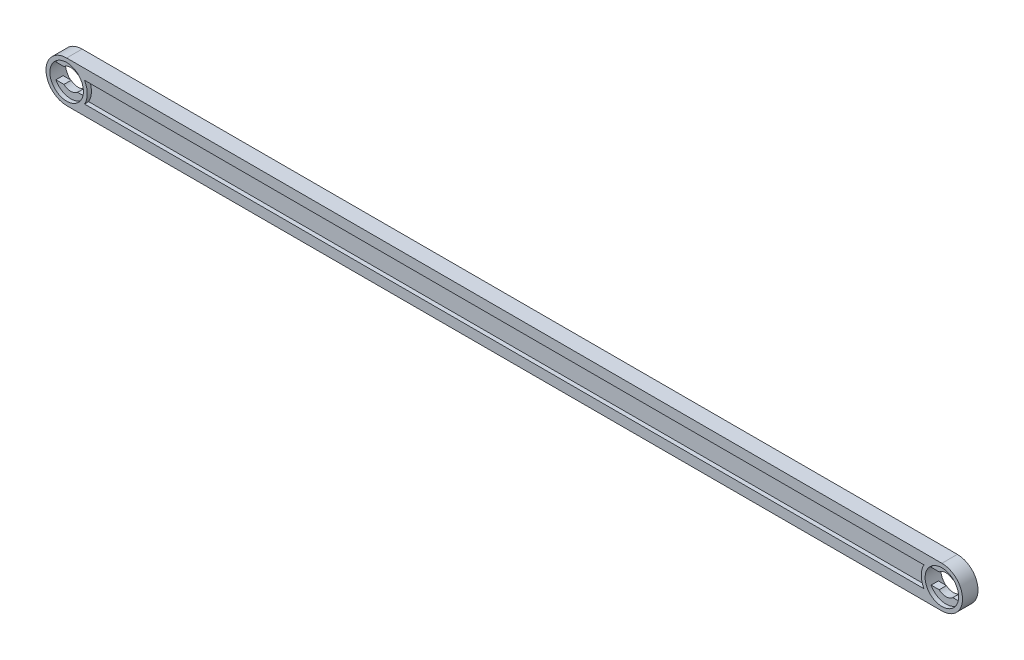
ISO-10303-21;
HEADER;
FILE_DESCRIPTION(('STEP AP214'),'2;1');
FILE_NAME('part.step','',(''),(''),'','','');
FILE_SCHEMA(('AUTOMOTIVE_DESIGN { 1 0 10303 214 1 1 1 1 }'));
ENDSEC;
DATA;
#1=APPLICATION_CONTEXT('core data for automotive mechanical design processes');
#2=APPLICATION_PROTOCOL_DEFINITION('international standard','automotive_design',2000,#1);
#3=PRODUCT_CONTEXT('',#1,'mechanical');
#4=PRODUCT('Part','Part','',(#3));
#5=PRODUCT_RELATED_PRODUCT_CATEGORY('part','',(#4));
#6=PRODUCT_DEFINITION_FORMATION('','',#4);
#7=PRODUCT_DEFINITION_CONTEXT('part definition',#1,'design');
#8=PRODUCT_DEFINITION('design','',#6,#7);
#9=PRODUCT_DEFINITION_SHAPE('','',#8);
#10=(LENGTH_UNIT() NAMED_UNIT(*) SI_UNIT(.MILLI.,.METRE.));
#11=(NAMED_UNIT(*) PLANE_ANGLE_UNIT() SI_UNIT($,.RADIAN.));
#12=(NAMED_UNIT(*) SI_UNIT($,.STERADIAN.) SOLID_ANGLE_UNIT());
#13=UNCERTAINTY_MEASURE_WITH_UNIT(LENGTH_MEASURE(1.E-05),#10,'distance_accuracy_value','');
#14=(GEOMETRIC_REPRESENTATION_CONTEXT(3) GLOBAL_UNCERTAINTY_ASSIGNED_CONTEXT((#13)) GLOBAL_UNIT_ASSIGNED_CONTEXT((#10,
#11,#12)) REPRESENTATION_CONTEXT('',''));
#15=CARTESIAN_POINT('',(0.,0.,0.));
#16=DIRECTION('',(0.,0.,1.));
#17=DIRECTION('',(1.,0.,0.));
#18=AXIS2_PLACEMENT_3D('',#15,#16,#17);
#19=CARTESIAN_POINT('',(0.,0.,-3.));
#20=DIRECTION('',(0.,0.,1.));
#21=DIRECTION('',(1.,0.,0.));
#22=AXIS2_PLACEMENT_3D('',#19,#20,#21);
#23=PLANE('',#22);
#24=DIRECTION('',(0.,-1.,0.));
#25=VECTOR('',#24,1.);
#26=CARTESIAN_POINT('',(165.6,-2.,-3.));
#27=LINE('',#26,#25);
#28=CARTESIAN_POINT('',(165.6,2.,-3.));
#29=VERTEX_POINT('',#28);
#30=CARTESIAN_POINT('',(165.6,-2.,-3.));
#31=VERTEX_POINT('',#30);
#32=EDGE_CURVE('E248',#29,#31,#27,.T.);
#33=ORIENTED_EDGE('',*,*,#32,.F.);
#34=DIRECTION('',(1.,0.,0.));
#35=VECTOR('',#34,1.);
#36=CARTESIAN_POINT('',(165.6,2.,-3.));
#37=LINE('',#36,#35);
#38=CARTESIAN_POINT('',(4.,2.,-3.));
#39=VERTEX_POINT('',#38);
#40=EDGE_CURVE('E49',#39,#29,#37,.T.);
#41=ORIENTED_EDGE('',*,*,#40,.F.);
#42=DIRECTION('',(0.,1.,0.));
#43=VECTOR('',#42,1.);
#44=CARTESIAN_POINT('',(4.00000000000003,-2.,-3.));
#45=LINE('',#44,#43);
#46=CARTESIAN_POINT('',(4.00000000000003,-2.,-3.));
#47=VERTEX_POINT('',#46);
#48=EDGE_CURVE('E239',#47,#39,#45,.T.);
#49=ORIENTED_EDGE('',*,*,#48,.F.);
#50=DIRECTION('',(-1.,0.,0.));
#51=VECTOR('',#50,1.);
#52=CARTESIAN_POINT('',(165.6,-2.,-3.));
#53=LINE('',#52,#51);
#54=EDGE_CURVE('E242',#31,#47,#53,.T.);
#55=ORIENTED_EDGE('',*,*,#54,.F.);
#56=EDGE_LOOP('',(#33,#41,#49,#55));
#57=FACE_BOUND('',#56,.T.);
#58=CARTESIAN_POINT('',(0.,0.,-3.));
#59=DIRECTION('',(0.,0.,1.));
#60=DIRECTION('',(1.,0.,0.));
#61=AXIS2_PLACEMENT_3D('',#58,#59,#60);
#62=CIRCLE('',#61,4.);
#63=CARTESIAN_POINT('',(0.,4.,-3.));
#64=VERTEX_POINT('',#63);
#65=CARTESIAN_POINT('',(0.,-4.,-3.));
#66=VERTEX_POINT('',#65);
#67=EDGE_CURVE('E414',#64,#66,#62,.T.);
#68=ORIENTED_EDGE('',*,*,#67,.F.);
#69=DIRECTION('',(-1.,0.,0.));
#70=VECTOR('',#69,1.);
#71=CARTESIAN_POINT('',(0.,4.,-3.));
#72=LINE('',#71,#70);
#73=CARTESIAN_POINT('',(169.6,4.,-3.));
#74=VERTEX_POINT('',#73);
#75=EDGE_CURVE('E424',#74,#64,#72,.T.);
#76=ORIENTED_EDGE('',*,*,#75,.F.);
#77=CARTESIAN_POINT('',(169.6,0.,-3.));
#78=DIRECTION('',(0.,0.,1.));
#79=DIRECTION('',(1.,0.,0.));
#80=AXIS2_PLACEMENT_3D('',#77,#78,#79);
#81=CIRCLE('',#80,4.);
#82=CARTESIAN_POINT('',(169.6,-4.,-3.));
#83=VERTEX_POINT('',#82);
#84=EDGE_CURVE('E421',#83,#74,#81,.T.);
#85=ORIENTED_EDGE('',*,*,#84,.F.);
#86=DIRECTION('',(1.,0.,0.));
#87=VECTOR('',#86,1.);
#88=CARTESIAN_POINT('',(0.,-4.,-3.));
#89=LINE('',#88,#87);
#90=EDGE_CURVE('E417',#66,#83,#89,.T.);
#91=ORIENTED_EDGE('',*,*,#90,.F.);
#92=EDGE_LOOP('',(#68,#76,#85,#91));
#93=FACE_BOUND('',#92,.T.);
#94=CARTESIAN_POINT('',(0.,0.,-3.));
#95=DIRECTION('',(0.,0.,1.));
#96=DIRECTION('',(1.,0.,0.));
#97=AXIS2_PLACEMENT_3D('',#94,#95,#96);
#98=CIRCLE('',#97,3.25);
#99=CARTESIAN_POINT('',(3.25,0.,-3.));
#100=VERTEX_POINT('',#99);
#101=EDGE_CURVE('E391',#100,#100,#98,.F.);
#102=ORIENTED_EDGE('',*,*,#101,.F.);
#103=EDGE_LOOP('',(#102));
#104=FACE_BOUND('',#103,.T.);
#105=CARTESIAN_POINT('',(169.6,0.,-3.));
#106=DIRECTION('',(0.,0.,1.));
#107=DIRECTION('',(1.,0.,0.));
#108=AXIS2_PLACEMENT_3D('',#105,#106,#107);
#109=CIRCLE('',#108,3.25);
#110=CARTESIAN_POINT('',(172.85,0.,-3.));
#111=VERTEX_POINT('',#110);
#112=EDGE_CURVE('E328',#111,#111,#109,.F.);
#113=ORIENTED_EDGE('',*,*,#112,.F.);
#114=EDGE_LOOP('',(#113));
#115=FACE_BOUND('',#114,.T.);
#116=ADVANCED_FACE('F34',(#57,#93,#104,#115),#23,.F.);
#117=CARTESIAN_POINT('',(166.716859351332,1.5,-3.001));
#118=DIRECTION('',(0.,1.,0.));
#119=DIRECTION('',(0.,0.,1.));
#120=AXIS2_PLACEMENT_3D('',#117,#118,#119);
#121=PLANE('',#120);
#122=DIRECTION('',(0.,0.,1.));
#123=VECTOR('',#122,1.);
#124=CARTESIAN_POINT('',(166.716859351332,1.5,-3.001));
#125=LINE('',#124,#123);
#126=CARTESIAN_POINT('',(166.716859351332,1.49999999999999,-2.2));
#127=VERTEX_POINT('',#126);
#128=CARTESIAN_POINT('',(166.716859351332,1.5,-0.8));
#129=VERTEX_POINT('',#128);
#130=EDGE_CURVE('E335',#127,#129,#125,.T.);
#131=ORIENTED_EDGE('',*,*,#130,.F.);
#132=DIRECTION('',(1.,0.,0.));
#133=VECTOR('',#132,1.);
#134=CARTESIAN_POINT('',(166.716859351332,1.5,-2.2));
#135=LINE('',#134,#133);
#136=CARTESIAN_POINT('',(168.277124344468,1.5,-2.2));
#137=VERTEX_POINT('',#136);
#138=EDGE_CURVE('E306',#127,#137,#135,.T.);
#139=ORIENTED_EDGE('',*,*,#138,.T.);
#140=DIRECTION('',(0.,0.,1.));
#141=VECTOR('',#140,1.);
#142=CARTESIAN_POINT('',(168.277124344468,1.5,-3.001));
#143=LINE('',#142,#141);
#144=CARTESIAN_POINT('',(168.277124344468,1.5,-0.8));
#145=VERTEX_POINT('',#144);
#146=EDGE_CURVE('E338',#137,#145,#143,.T.);
#147=ORIENTED_EDGE('',*,*,#146,.T.);
#148=DIRECTION('',(1.,0.,0.));
#149=VECTOR('',#148,1.);
#150=CARTESIAN_POINT('',(166.716859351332,1.5,-0.8));
#151=LINE('',#150,#149);
#152=EDGE_CURVE('E325',#129,#145,#151,.T.);
#153=ORIENTED_EDGE('',*,*,#152,.F.);
#154=EDGE_LOOP('',(#131,#139,#147,#153));
#155=FACE_BOUND('',#154,.T.);
#156=ADVANCED_FACE('F483',(#155),#121,.F.);
#157=CARTESIAN_POINT('',(169.6,0.,-3.001));
#158=DIRECTION('',(0.,0.,1.));
#159=DIRECTION('',(1.,0.,0.));
#160=AXIS2_PLACEMENT_3D('',#157,#158,#159);
#161=CYLINDRICAL_SURFACE('',#160,2.);
#162=ORIENTED_EDGE('',*,*,#146,.F.);
#163=CARTESIAN_POINT('',(169.6,0.,-2.2));
#164=DIRECTION('',(0.,0.,1.));
#165=DIRECTION('',(1.,0.,0.));
#166=AXIS2_PLACEMENT_3D('',#163,#164,#165);
#167=CIRCLE('',#166,2.);
#168=CARTESIAN_POINT('',(170.922875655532,1.5,-2.2));
#169=VERTEX_POINT('',#168);
#170=EDGE_CURVE('E303',#137,#169,#167,.F.);
#171=ORIENTED_EDGE('',*,*,#170,.T.);
#172=DIRECTION('',(0.,0.,1.));
#173=VECTOR('',#172,1.);
#174=CARTESIAN_POINT('',(170.922875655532,1.5,-3.001));
#175=LINE('',#174,#173);
#176=CARTESIAN_POINT('',(170.922875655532,1.5,-0.800000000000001));
#177=VERTEX_POINT('',#176);
#178=EDGE_CURVE('E340',#169,#177,#175,.T.);
#179=ORIENTED_EDGE('',*,*,#178,.T.);
#180=CARTESIAN_POINT('',(169.6,0.,-0.8));
#181=DIRECTION('',(0.,0.,1.));
#182=DIRECTION('',(1.,0.,0.));
#183=AXIS2_PLACEMENT_3D('',#180,#181,#182);
#184=CIRCLE('',#183,2.);
#185=EDGE_CURVE('E322',#145,#177,#184,.F.);
#186=ORIENTED_EDGE('',*,*,#185,.F.);
#187=EDGE_LOOP('',(#162,#171,#179,#186));
#188=FACE_BOUND('',#187,.T.);
#189=ADVANCED_FACE('F489',(#188),#161,.F.);
#190=CARTESIAN_POINT('',(170.922875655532,1.5,-3.001));
#191=DIRECTION('',(0.,1.,0.));
#192=DIRECTION('',(0.,0.,1.));
#193=AXIS2_PLACEMENT_3D('',#190,#191,#192);
#194=PLANE('',#193);
#195=ORIENTED_EDGE('',*,*,#178,.F.);
#196=DIRECTION('',(1.,0.,0.));
#197=VECTOR('',#196,1.);
#198=CARTESIAN_POINT('',(170.922875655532,1.5,-2.2));
#199=LINE('',#198,#197);
#200=CARTESIAN_POINT('',(172.483140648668,1.49999999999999,-2.2));
#201=VERTEX_POINT('',#200);
#202=EDGE_CURVE('E300',#169,#201,#199,.T.);
#203=ORIENTED_EDGE('',*,*,#202,.T.);
#204=DIRECTION('',(0.,0.,1.));
#205=VECTOR('',#204,1.);
#206=CARTESIAN_POINT('',(172.483140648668,1.5,-3.001));
#207=LINE('',#206,#205);
#208=CARTESIAN_POINT('',(172.483140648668,1.49999999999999,-0.8));
#209=VERTEX_POINT('',#208);
#210=EDGE_CURVE('E342',#201,#209,#207,.T.);
#211=ORIENTED_EDGE('',*,*,#210,.T.);
#212=DIRECTION('',(1.,0.,0.));
#213=VECTOR('',#212,1.);
#214=CARTESIAN_POINT('',(170.922875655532,1.5,-0.8));
#215=LINE('',#214,#213);
#216=EDGE_CURVE('E319',#177,#209,#215,.T.);
#217=ORIENTED_EDGE('',*,*,#216,.F.);
#218=EDGE_LOOP('',(#195,#203,#211,#217));
#219=FACE_BOUND('',#218,.T.);
#220=ADVANCED_FACE('F660',(#219),#194,.F.);
#221=CARTESIAN_POINT('',(170.922875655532,-1.5,-3.001));
#222=DIRECTION('',(0.,-1.,0.));
#223=DIRECTION('',(0.,0.,-1.));
#224=AXIS2_PLACEMENT_3D('',#221,#222,#223);
#225=PLANE('',#224);
#226=DIRECTION('',(0.,0.,1.));
#227=VECTOR('',#226,1.);
#228=CARTESIAN_POINT('',(172.483140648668,-1.5,-3.001));
#229=LINE('',#228,#227);
#230=CARTESIAN_POINT('',(172.483140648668,-1.49999999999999,-2.2));
#231=VERTEX_POINT('',#230);
#232=CARTESIAN_POINT('',(172.483140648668,-1.5,-0.8));
#233=VERTEX_POINT('',#232);
#234=EDGE_CURVE('E344',#231,#233,#229,.T.);
#235=ORIENTED_EDGE('',*,*,#234,.F.);
#236=DIRECTION('',(-1.,0.,0.));
#237=VECTOR('',#236,1.);
#238=CARTESIAN_POINT('',(170.922875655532,-1.5,-2.2));
#239=LINE('',#238,#237);
#240=CARTESIAN_POINT('',(170.922875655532,-1.5,-2.2));
#241=VERTEX_POINT('',#240);
#242=EDGE_CURVE('E297',#231,#241,#239,.T.);
#243=ORIENTED_EDGE('',*,*,#242,.T.);
#244=DIRECTION('',(0.,0.,1.));
#245=VECTOR('',#244,1.);
#246=CARTESIAN_POINT('',(170.922875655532,-1.5,-3.001));
#247=LINE('',#246,#245);
#248=CARTESIAN_POINT('',(170.922875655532,-1.5,-0.8));
#249=VERTEX_POINT('',#248);
#250=EDGE_CURVE('E346',#241,#249,#247,.T.);
#251=ORIENTED_EDGE('',*,*,#250,.T.);
#252=DIRECTION('',(-1.,0.,0.));
#253=VECTOR('',#252,1.);
#254=CARTESIAN_POINT('',(170.922875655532,-1.5,-0.8));
#255=LINE('',#254,#253);
#256=EDGE_CURVE('E316',#233,#249,#255,.T.);
#257=ORIENTED_EDGE('',*,*,#256,.F.);
#258=EDGE_LOOP('',(#235,#243,#251,#257));
#259=FACE_BOUND('',#258,.T.);
#260=ADVANCED_FACE('F670',(#259),#225,.F.);
#261=CARTESIAN_POINT('',(169.6,0.,-3.001));
#262=DIRECTION('',(0.,0.,1.));
#263=DIRECTION('',(1.,0.,0.));
#264=AXIS2_PLACEMENT_3D('',#261,#262,#263);
#265=CYLINDRICAL_SURFACE('',#264,2.);
#266=ORIENTED_EDGE('',*,*,#250,.F.);
#267=CARTESIAN_POINT('',(169.6,0.,-2.2));
#268=DIRECTION('',(0.,0.,1.));
#269=DIRECTION('',(1.,0.,0.));
#270=AXIS2_PLACEMENT_3D('',#267,#268,#269);
#271=CIRCLE('',#270,2.);
#272=CARTESIAN_POINT('',(168.277124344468,-1.5,-2.2));
#273=VERTEX_POINT('',#272);
#274=EDGE_CURVE('E294',#241,#273,#271,.F.);
#275=ORIENTED_EDGE('',*,*,#274,.T.);
#276=DIRECTION('',(0.,0.,1.));
#277=VECTOR('',#276,1.);
#278=CARTESIAN_POINT('',(168.277124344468,-1.5,-3.001));
#279=LINE('',#278,#277);
#280=CARTESIAN_POINT('',(168.277124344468,-1.5,-0.800000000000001));
#281=VERTEX_POINT('',#280);
#282=EDGE_CURVE('E348',#273,#281,#279,.T.);
#283=ORIENTED_EDGE('',*,*,#282,.T.);
#284=CARTESIAN_POINT('',(169.6,0.,-0.8));
#285=DIRECTION('',(0.,0.,1.));
#286=DIRECTION('',(1.,0.,0.));
#287=AXIS2_PLACEMENT_3D('',#284,#285,#286);
#288=CIRCLE('',#287,2.);
#289=EDGE_CURVE('E313',#249,#281,#288,.F.);
#290=ORIENTED_EDGE('',*,*,#289,.F.);
#291=EDGE_LOOP('',(#266,#275,#283,#290));
#292=FACE_BOUND('',#291,.T.);
#293=ADVANCED_FACE('F680',(#292),#265,.F.);
#294=CARTESIAN_POINT('',(166.716859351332,-1.5,-3.001));
#295=DIRECTION('',(0.,-1.,0.));
#296=DIRECTION('',(0.,0.,-1.));
#297=AXIS2_PLACEMENT_3D('',#294,#295,#296);
#298=PLANE('',#297);
#299=ORIENTED_EDGE('',*,*,#282,.F.);
#300=DIRECTION('',(-1.,0.,0.));
#301=VECTOR('',#300,1.);
#302=CARTESIAN_POINT('',(166.716859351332,-1.5,-2.2));
#303=LINE('',#302,#301);
#304=CARTESIAN_POINT('',(166.716859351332,-1.49999999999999,-2.2));
#305=VERTEX_POINT('',#304);
#306=EDGE_CURVE('E291',#273,#305,#303,.T.);
#307=ORIENTED_EDGE('',*,*,#306,.T.);
#308=DIRECTION('',(0.,0.,1.));
#309=VECTOR('',#308,1.);
#310=CARTESIAN_POINT('',(166.716859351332,-1.5,-3.001));
#311=LINE('',#310,#309);
#312=CARTESIAN_POINT('',(166.716859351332,-1.5,-0.8));
#313=VERTEX_POINT('',#312);
#314=EDGE_CURVE('E334',#305,#313,#311,.T.);
#315=ORIENTED_EDGE('',*,*,#314,.T.);
#316=DIRECTION('',(-1.,0.,0.));
#317=VECTOR('',#316,1.);
#318=CARTESIAN_POINT('',(166.716859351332,-1.5,-0.8));
#319=LINE('',#318,#317);
#320=EDGE_CURVE('E11',#281,#313,#319,.T.);
#321=ORIENTED_EDGE('',*,*,#320,.F.);
#322=EDGE_LOOP('',(#299,#307,#315,#321));
#323=FACE_BOUND('',#322,.T.);
#324=ADVANCED_FACE('F602',(#323),#298,.F.);
#325=CARTESIAN_POINT('',(-2.8831406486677,1.5,-3.001));
#326=DIRECTION('',(0.,1.,0.));
#327=DIRECTION('',(0.,0.,1.));
#328=AXIS2_PLACEMENT_3D('',#325,#326,#327);
#329=PLANE('',#328);
#330=DIRECTION('',(0.,0.,1.));
#331=VECTOR('',#330,1.);
#332=CARTESIAN_POINT('',(-2.8831406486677,1.5,-3.001));
#333=LINE('',#332,#331);
#334=CARTESIAN_POINT('',(-2.8831406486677,1.5,-2.2));
#335=VERTEX_POINT('',#334);
#336=CARTESIAN_POINT('',(-2.8831406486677,1.5,-0.8));
#337=VERTEX_POINT('',#336);
#338=EDGE_CURVE('E398',#335,#337,#333,.T.);
#339=ORIENTED_EDGE('',*,*,#338,.F.);
#340=DIRECTION('',(1.,0.,0.));
#341=VECTOR('',#340,1.);
#342=CARTESIAN_POINT('',(-2.8831406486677,1.5,-2.2));
#343=LINE('',#342,#341);
#344=CARTESIAN_POINT('',(-1.3228756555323,1.5,-2.2));
#345=VERTEX_POINT('',#344);
#346=EDGE_CURVE('E369',#335,#345,#343,.T.);
#347=ORIENTED_EDGE('',*,*,#346,.T.);
#348=DIRECTION('',(0.,0.,1.));
#349=VECTOR('',#348,1.);
#350=CARTESIAN_POINT('',(-1.3228756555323,1.5,-3.001));
#351=LINE('',#350,#349);
#352=CARTESIAN_POINT('',(-1.3228756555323,1.5,-0.8));
#353=VERTEX_POINT('',#352);
#354=EDGE_CURVE('E401',#345,#353,#351,.T.);
#355=ORIENTED_EDGE('',*,*,#354,.T.);
#356=DIRECTION('',(1.,0.,0.));
#357=VECTOR('',#356,1.);
#358=CARTESIAN_POINT('',(-2.8831406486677,1.5,-0.8));
#359=LINE('',#358,#357);
#360=EDGE_CURVE('E388',#337,#353,#359,.T.);
#361=ORIENTED_EDGE('',*,*,#360,.F.);
#362=EDGE_LOOP('',(#339,#347,#355,#361));
#363=FACE_BOUND('',#362,.T.);
#364=ADVANCED_FACE('F538',(#363),#329,.F.);
#365=CARTESIAN_POINT('',(0.,0.,-3.001));
#366=DIRECTION('',(0.,0.,1.));
#367=DIRECTION('',(1.,0.,0.));
#368=AXIS2_PLACEMENT_3D('',#365,#366,#367);
#369=CYLINDRICAL_SURFACE('',#368,2.);
#370=ORIENTED_EDGE('',*,*,#354,.F.);
#371=CARTESIAN_POINT('',(0.,0.,-2.2));
#372=DIRECTION('',(0.,0.,1.));
#373=DIRECTION('',(1.,0.,0.));
#374=AXIS2_PLACEMENT_3D('',#371,#372,#373);
#375=CIRCLE('',#374,2.);
#376=CARTESIAN_POINT('',(1.3228756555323,1.5,-2.2));
#377=VERTEX_POINT('',#376);
#378=EDGE_CURVE('E366',#345,#377,#375,.F.);
#379=ORIENTED_EDGE('',*,*,#378,.T.);
#380=DIRECTION('',(0.,0.,1.));
#381=VECTOR('',#380,1.);
#382=CARTESIAN_POINT('',(1.3228756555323,1.5,-3.001));
#383=LINE('',#382,#381);
#384=CARTESIAN_POINT('',(1.3228756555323,1.5,-0.800000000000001));
#385=VERTEX_POINT('',#384);
#386=EDGE_CURVE('E403',#377,#385,#383,.T.);
#387=ORIENTED_EDGE('',*,*,#386,.T.);
#388=CARTESIAN_POINT('',(0.,0.,-0.8));
#389=DIRECTION('',(0.,0.,1.));
#390=DIRECTION('',(1.,0.,0.));
#391=AXIS2_PLACEMENT_3D('',#388,#389,#390);
#392=CIRCLE('',#391,2.);
#393=EDGE_CURVE('E385',#353,#385,#392,.F.);
#394=ORIENTED_EDGE('',*,*,#393,.F.);
#395=EDGE_LOOP('',(#370,#379,#387,#394));
#396=FACE_BOUND('',#395,.T.);
#397=ADVANCED_FACE('F544',(#396),#369,.F.);
#398=CARTESIAN_POINT('',(1.3228756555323,1.5,-3.001));
#399=DIRECTION('',(0.,1.,0.));
#400=DIRECTION('',(0.,0.,1.));
#401=AXIS2_PLACEMENT_3D('',#398,#399,#400);
#402=PLANE('',#401);
#403=ORIENTED_EDGE('',*,*,#386,.F.);
#404=DIRECTION('',(1.,0.,0.));
#405=VECTOR('',#404,1.);
#406=CARTESIAN_POINT('',(1.3228756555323,1.5,-2.2));
#407=LINE('',#406,#405);
#408=CARTESIAN_POINT('',(2.8831406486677,1.5,-2.2));
#409=VERTEX_POINT('',#408);
#410=EDGE_CURVE('E363',#377,#409,#407,.T.);
#411=ORIENTED_EDGE('',*,*,#410,.T.);
#412=DIRECTION('',(0.,0.,1.));
#413=VECTOR('',#412,1.);
#414=CARTESIAN_POINT('',(2.8831406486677,1.5,-3.001));
#415=LINE('',#414,#413);
#416=CARTESIAN_POINT('',(2.8831406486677,1.5,-0.8));
#417=VERTEX_POINT('',#416);
#418=EDGE_CURVE('E405',#409,#417,#415,.T.);
#419=ORIENTED_EDGE('',*,*,#418,.T.);
#420=DIRECTION('',(1.,0.,0.));
#421=VECTOR('',#420,1.);
#422=CARTESIAN_POINT('',(1.3228756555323,1.5,-0.8));
#423=LINE('',#422,#421);
#424=EDGE_CURVE('E382',#385,#417,#423,.T.);
#425=ORIENTED_EDGE('',*,*,#424,.F.);
#426=EDGE_LOOP('',(#403,#411,#419,#425));
#427=FACE_BOUND('',#426,.T.);
#428=ADVANCED_FACE('F547',(#427),#402,.F.);
#429=CARTESIAN_POINT('',(1.3228756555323,-1.5,-3.001));
#430=DIRECTION('',(0.,-1.,0.));
#431=DIRECTION('',(0.,0.,-1.));
#432=AXIS2_PLACEMENT_3D('',#429,#430,#431);
#433=PLANE('',#432);
#434=DIRECTION('',(0.,0.,1.));
#435=VECTOR('',#434,1.);
#436=CARTESIAN_POINT('',(2.8831406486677,-1.5,-3.001));
#437=LINE('',#436,#435);
#438=CARTESIAN_POINT('',(2.8831406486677,-1.5,-2.2));
#439=VERTEX_POINT('',#438);
#440=CARTESIAN_POINT('',(2.8831406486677,-1.5,-0.8));
#441=VERTEX_POINT('',#440);
#442=EDGE_CURVE('E407',#439,#441,#437,.T.);
#443=ORIENTED_EDGE('',*,*,#442,.F.);
#444=DIRECTION('',(-1.,0.,0.));
#445=VECTOR('',#444,1.);
#446=CARTESIAN_POINT('',(1.3228756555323,-1.5,-2.2));
#447=LINE('',#446,#445);
#448=CARTESIAN_POINT('',(1.32287565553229,-1.5,-2.2));
#449=VERTEX_POINT('',#448);
#450=EDGE_CURVE('E360',#439,#449,#447,.T.);
#451=ORIENTED_EDGE('',*,*,#450,.T.);
#452=DIRECTION('',(0.,0.,1.));
#453=VECTOR('',#452,1.);
#454=CARTESIAN_POINT('',(1.32287565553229,-1.5,-3.001));
#455=LINE('',#454,#453);
#456=CARTESIAN_POINT('',(1.32287565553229,-1.5,-0.8));
#457=VERTEX_POINT('',#456);
#458=EDGE_CURVE('E409',#449,#457,#455,.T.);
#459=ORIENTED_EDGE('',*,*,#458,.T.);
#460=DIRECTION('',(-1.,0.,0.));
#461=VECTOR('',#460,1.);
#462=CARTESIAN_POINT('',(1.3228756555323,-1.5,-0.8));
#463=LINE('',#462,#461);
#464=EDGE_CURVE('E379',#441,#457,#463,.T.);
#465=ORIENTED_EDGE('',*,*,#464,.F.);
#466=EDGE_LOOP('',(#443,#451,#459,#465));
#467=FACE_BOUND('',#466,.T.);
#468=ADVANCED_FACE('F461',(#467),#433,.F.);
#469=CARTESIAN_POINT('',(0.,0.,-3.001));
#470=DIRECTION('',(0.,0.,1.));
#471=DIRECTION('',(1.,0.,0.));
#472=AXIS2_PLACEMENT_3D('',#469,#470,#471);
#473=CYLINDRICAL_SURFACE('',#472,2.);
#474=ORIENTED_EDGE('',*,*,#458,.F.);
#475=CARTESIAN_POINT('',(0.,0.,-2.2));
#476=DIRECTION('',(0.,0.,1.));
#477=DIRECTION('',(1.,0.,0.));
#478=AXIS2_PLACEMENT_3D('',#475,#476,#477);
#479=CIRCLE('',#478,2.);
#480=CARTESIAN_POINT('',(-1.3228756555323,-1.5,-2.2));
#481=VERTEX_POINT('',#480);
#482=EDGE_CURVE('E357',#449,#481,#479,.F.);
#483=ORIENTED_EDGE('',*,*,#482,.T.);
#484=DIRECTION('',(0.,0.,1.));
#485=VECTOR('',#484,1.);
#486=CARTESIAN_POINT('',(-1.3228756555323,-1.5,-3.001));
#487=LINE('',#486,#485);
#488=CARTESIAN_POINT('',(-1.3228756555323,-1.5,-0.800000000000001));
#489=VERTEX_POINT('',#488);
#490=EDGE_CURVE('E411',#481,#489,#487,.T.);
#491=ORIENTED_EDGE('',*,*,#490,.T.);
#492=CARTESIAN_POINT('',(0.,0.,-0.8));
#493=DIRECTION('',(0.,0.,1.));
#494=DIRECTION('',(1.,0.,0.));
#495=AXIS2_PLACEMENT_3D('',#492,#493,#494);
#496=CIRCLE('',#495,2.);
#497=EDGE_CURVE('E376',#457,#489,#496,.F.);
#498=ORIENTED_EDGE('',*,*,#497,.F.);
#499=EDGE_LOOP('',(#474,#483,#491,#498));
#500=FACE_BOUND('',#499,.T.);
#501=ADVANCED_FACE('F464',(#500),#473,.F.);
#502=CARTESIAN_POINT('',(-2.8831406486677,-1.5,-3.001));
#503=DIRECTION('',(0.,-1.,0.));
#504=DIRECTION('',(0.,0.,-1.));
#505=AXIS2_PLACEMENT_3D('',#502,#503,#504);
#506=PLANE('',#505);
#507=ORIENTED_EDGE('',*,*,#490,.F.);
#508=DIRECTION('',(-1.,0.,0.));
#509=VECTOR('',#508,1.);
#510=CARTESIAN_POINT('',(-2.8831406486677,-1.5,-2.2));
#511=LINE('',#510,#509);
#512=CARTESIAN_POINT('',(-2.8831406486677,-1.5,-2.2));
#513=VERTEX_POINT('',#512);
#514=EDGE_CURVE('E354',#481,#513,#511,.T.);
#515=ORIENTED_EDGE('',*,*,#514,.T.);
#516=DIRECTION('',(0.,0.,1.));
#517=VECTOR('',#516,1.);
#518=CARTESIAN_POINT('',(-2.8831406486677,-1.5,-3.001));
#519=LINE('',#518,#517);
#520=CARTESIAN_POINT('',(-2.8831406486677,-1.5,-0.8));
#521=VERTEX_POINT('',#520);
#522=EDGE_CURVE('E397',#513,#521,#519,.T.);
#523=ORIENTED_EDGE('',*,*,#522,.T.);
#524=DIRECTION('',(-1.,0.,0.));
#525=VECTOR('',#524,1.);
#526=CARTESIAN_POINT('',(-2.8831406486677,-1.5,-0.8));
#527=LINE('',#526,#525);
#528=EDGE_CURVE('E42',#489,#521,#527,.T.);
#529=ORIENTED_EDGE('',*,*,#528,.F.);
#530=EDGE_LOOP('',(#507,#515,#523,#529));
#531=FACE_BOUND('',#530,.T.);
#532=ADVANCED_FACE('F465',(#531),#506,.F.);
#533=CARTESIAN_POINT('',(0.,0.,-3.));
#534=DIRECTION('',(0.,0.,1.));
#535=DIRECTION('',(1.,0.,0.));
#536=AXIS2_PLACEMENT_3D('',#533,#534,#535);
#537=CYLINDRICAL_SURFACE('',#536,4.);
#538=CARTESIAN_POINT('',(0.,0.,0.));
#539=DIRECTION('',(0.,0.,1.));
#540=DIRECTION('',(1.,0.,0.));
#541=AXIS2_PLACEMENT_3D('',#538,#539,#540);
#542=CIRCLE('',#541,4.);
#543=CARTESIAN_POINT('',(0.,4.,0.));
#544=VERTEX_POINT('',#543);
#545=CARTESIAN_POINT('',(0.,-4.,0.));
#546=VERTEX_POINT('',#545);
#547=EDGE_CURVE('E400',#544,#546,#542,.T.);
#548=ORIENTED_EDGE('',*,*,#547,.F.);
#549=DIRECTION('',(0.,0.,1.));
#550=VECTOR('',#549,1.);
#551=CARTESIAN_POINT('',(0.,4.,-3.));
#552=LINE('',#551,#550);
#553=EDGE_CURVE('E438',#64,#544,#552,.T.);
#554=ORIENTED_EDGE('',*,*,#553,.F.);
#555=ORIENTED_EDGE('',*,*,#67,.T.);
#556=DIRECTION('',(0.,0.,1.));
#557=VECTOR('',#556,1.);
#558=CARTESIAN_POINT('',(0.,-4.,-3.));
#559=LINE('',#558,#557);
#560=EDGE_CURVE('E427',#66,#546,#559,.T.);
#561=ORIENTED_EDGE('',*,*,#560,.T.);
#562=EDGE_LOOP('',(#548,#554,#555,#561));
#563=FACE_BOUND('',#562,.T.);
#564=ADVANCED_FACE('F36',(#563),#537,.T.);
#565=CARTESIAN_POINT('',(0.,4.,-3.));
#566=DIRECTION('',(0.,1.,0.));
#567=DIRECTION('',(0.,0.,1.));
#568=AXIS2_PLACEMENT_3D('',#565,#566,#567);
#569=PLANE('',#568);
#570=DIRECTION('',(-1.,0.,0.));
#571=VECTOR('',#570,1.);
#572=CARTESIAN_POINT('',(0.,4.,0.));
#573=LINE('',#572,#571);
#574=CARTESIAN_POINT('',(169.6,4.,0.));
#575=VERTEX_POINT('',#574);
#576=EDGE_CURVE('E418',#575,#544,#573,.T.);
#577=ORIENTED_EDGE('',*,*,#576,.F.);
#578=DIRECTION('',(0.,0.,1.));
#579=VECTOR('',#578,1.);
#580=CARTESIAN_POINT('',(169.6,4.,-3.));
#581=LINE('',#580,#579);
#582=EDGE_CURVE('E440',#74,#575,#581,.T.);
#583=ORIENTED_EDGE('',*,*,#582,.F.);
#584=ORIENTED_EDGE('',*,*,#75,.T.);
#585=ORIENTED_EDGE('',*,*,#553,.T.);
#586=EDGE_LOOP('',(#577,#583,#584,#585));
#587=FACE_BOUND('',#586,.T.);
#588=ADVANCED_FACE('F501',(#587),#569,.T.);
#589=CARTESIAN_POINT('',(169.6,0.,-3.));
#590=DIRECTION('',(0.,0.,1.));
#591=DIRECTION('',(1.,0.,0.));
#592=AXIS2_PLACEMENT_3D('',#589,#590,#591);
#593=CYLINDRICAL_SURFACE('',#592,4.);
#594=CARTESIAN_POINT('',(169.6,0.,0.));
#595=DIRECTION('',(0.,0.,1.));
#596=DIRECTION('',(1.,0.,0.));
#597=AXIS2_PLACEMENT_3D('',#594,#595,#596);
#598=CIRCLE('',#597,4.);
#599=CARTESIAN_POINT('',(169.6,-4.,0.));
#600=VERTEX_POINT('',#599);
#601=EDGE_CURVE('E433',#600,#575,#598,.T.);
#602=ORIENTED_EDGE('',*,*,#601,.F.);
#603=DIRECTION('',(0.,0.,1.));
#604=VECTOR('',#603,1.);
#605=CARTESIAN_POINT('',(169.6,-4.,-3.));
#606=LINE('',#605,#604);
#607=EDGE_CURVE('E442',#83,#600,#606,.T.);
#608=ORIENTED_EDGE('',*,*,#607,.F.);
#609=ORIENTED_EDGE('',*,*,#84,.T.);
#610=ORIENTED_EDGE('',*,*,#582,.T.);
#611=EDGE_LOOP('',(#602,#608,#609,#610));
#612=FACE_BOUND('',#611,.T.);
#613=ADVANCED_FACE('F504',(#612),#593,.T.);
#614=CARTESIAN_POINT('',(0.,-4.,-3.));
#615=DIRECTION('',(0.,-1.,0.));
#616=DIRECTION('',(0.,0.,-1.));
#617=AXIS2_PLACEMENT_3D('',#614,#615,#616);
#618=PLANE('',#617);
#619=DIRECTION('',(1.,0.,0.));
#620=VECTOR('',#619,1.);
#621=CARTESIAN_POINT('',(0.,-4.,0.));
#622=LINE('',#621,#620);
#623=EDGE_CURVE('E430',#546,#600,#622,.T.);
#624=ORIENTED_EDGE('',*,*,#623,.F.);
#625=ORIENTED_EDGE('',*,*,#560,.F.);
#626=ORIENTED_EDGE('',*,*,#90,.T.);
#627=ORIENTED_EDGE('',*,*,#607,.T.);
#628=EDGE_LOOP('',(#624,#625,#626,#627));
#629=FACE_BOUND('',#628,.T.);
#630=ADVANCED_FACE('F499',(#629),#618,.T.);
#631=CARTESIAN_POINT('',(0.,0.,0.));
#632=DIRECTION('',(0.,0.,1.));
#633=DIRECTION('',(1.,0.,0.));
#634=AXIS2_PLACEMENT_3D('',#631,#632,#633);
#635=PLANE('',#634);
#636=CARTESIAN_POINT('',(0.,0.,0.));
#637=DIRECTION('',(0.,0.,-1.));
#638=DIRECTION('',(1.,0.,0.));
#639=AXIS2_PLACEMENT_3D('',#636,#637,#638);
#640=CIRCLE('',#639,4.);
#641=CARTESIAN_POINT('',(3.46410161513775,2.,0.));
#642=VERTEX_POINT('',#641);
#643=CARTESIAN_POINT('',(3.46410161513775,-2.,0.));
#644=VERTEX_POINT('',#643);
#645=EDGE_CURVE('E57',#642,#644,#640,.T.);
#646=ORIENTED_EDGE('',*,*,#645,.F.);
#647=DIRECTION('',(-1.,0.,0.));
#648=VECTOR('',#647,1.);
#649=CARTESIAN_POINT('',(3.46410161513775,2.,0.));
#650=LINE('',#649,#648);
#651=CARTESIAN_POINT('',(166.135898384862,2.00000000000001,0.));
#652=VERTEX_POINT('',#651);
#653=EDGE_CURVE('E261',#652,#642,#650,.T.);
#654=ORIENTED_EDGE('',*,*,#653,.F.);
#655=CARTESIAN_POINT('',(169.6,0.,0.));
#656=DIRECTION('',(0.,0.,-1.));
#657=DIRECTION('',(1.,0.,0.));
#658=AXIS2_PLACEMENT_3D('',#655,#656,#657);
#659=CIRCLE('',#658,4.);
#660=CARTESIAN_POINT('',(166.135898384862,-2.00000000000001,0.));
#661=VERTEX_POINT('',#660);
#662=EDGE_CURVE('E275',#661,#652,#659,.T.);
#663=ORIENTED_EDGE('',*,*,#662,.F.);
#664=DIRECTION('',(1.,0.,0.));
#665=VECTOR('',#664,1.);
#666=CARTESIAN_POINT('',(3.46410161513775,-2.,0.));
#667=LINE('',#666,#665);
#668=EDGE_CURVE('E272',#644,#661,#667,.T.);
#669=ORIENTED_EDGE('',*,*,#668,.F.);
#670=EDGE_LOOP('',(#646,#654,#663,#669));
#671=FACE_BOUND('',#670,.T.);
#672=CARTESIAN_POINT('',(169.6,0.,0.));
#673=DIRECTION('',(0.,0.,1.));
#674=DIRECTION('',(1.,0.,0.));
#675=AXIS2_PLACEMENT_3D('',#672,#673,#674);
#676=CIRCLE('',#675,3.25);
#677=CARTESIAN_POINT('',(172.85,0.,0.));
#678=VERTEX_POINT('',#677);
#679=EDGE_CURVE('E331',#678,#678,#676,.T.);
#680=ORIENTED_EDGE('',*,*,#679,.F.);
#681=EDGE_LOOP('',(#680));
#682=FACE_BOUND('',#681,.T.);
#683=CARTESIAN_POINT('',(0.,0.,0.));
#684=DIRECTION('',(0.,0.,1.));
#685=DIRECTION('',(1.,0.,0.));
#686=AXIS2_PLACEMENT_3D('',#683,#684,#685);
#687=CIRCLE('',#686,3.25);
#688=CARTESIAN_POINT('',(3.25,0.,0.));
#689=VERTEX_POINT('',#688);
#690=EDGE_CURVE('E394',#689,#689,#687,.T.);
#691=ORIENTED_EDGE('',*,*,#690,.F.);
#692=EDGE_LOOP('',(#691));
#693=FACE_BOUND('',#692,.T.);
#694=ORIENTED_EDGE('',*,*,#547,.T.);
#695=ORIENTED_EDGE('',*,*,#623,.T.);
#696=ORIENTED_EDGE('',*,*,#601,.T.);
#697=ORIENTED_EDGE('',*,*,#576,.T.);
#698=EDGE_LOOP('',(#694,#695,#696,#697));
#699=FACE_BOUND('',#698,.T.);
#700=ADVANCED_FACE('F496',(#671,#682,#693,#699),#635,.T.);
#701=CARTESIAN_POINT('',(0.,0.,-3.001));
#702=DIRECTION('',(0.,0.,1.));
#703=DIRECTION('',(1.,0.,0.));
#704=AXIS2_PLACEMENT_3D('',#701,#702,#703);
#705=CYLINDRICAL_SURFACE('',#704,3.25);
#706=CARTESIAN_POINT('',(0.,0.,-2.2));
#707=DIRECTION('',(0.,0.,1.));
#708=DIRECTION('',(1.,0.,0.));
#709=AXIS2_PLACEMENT_3D('',#706,#707,#708);
#710=CIRCLE('',#709,3.25);
#711=EDGE_CURVE('E351',#409,#335,#710,.T.);
#712=ORIENTED_EDGE('',*,*,#711,.T.);
#713=ORIENTED_EDGE('',*,*,#338,.T.);
#714=CARTESIAN_POINT('',(0.,0.,-0.8));
#715=DIRECTION('',(0.,0.,1.));
#716=DIRECTION('',(1.,0.,0.));
#717=AXIS2_PLACEMENT_3D('',#714,#715,#716);
#718=CIRCLE('',#717,3.25);
#719=EDGE_CURVE('E373',#417,#337,#718,.T.);
#720=ORIENTED_EDGE('',*,*,#719,.F.);
#721=ORIENTED_EDGE('',*,*,#418,.F.);
#722=EDGE_LOOP('',(#712,#713,#720,#721));
#723=FACE_BOUND('',#722,.T.);
#724=EDGE_CURVE('E337',#513,#439,#710,.T.);
#725=ORIENTED_EDGE('',*,*,#724,.T.);
#726=ORIENTED_EDGE('',*,*,#442,.T.);
#727=EDGE_CURVE('E372',#521,#441,#718,.T.);
#728=ORIENTED_EDGE('',*,*,#727,.F.);
#729=ORIENTED_EDGE('',*,*,#522,.F.);
#730=EDGE_LOOP('',(#725,#726,#728,#729));
#731=FACE_BOUND('',#730,.T.);
#732=ORIENTED_EDGE('',*,*,#690,.T.);
#733=EDGE_LOOP('',(#732));
#734=FACE_BOUND('',#733,.T.);
#735=ORIENTED_EDGE('',*,*,#101,.T.);
#736=EDGE_LOOP('',(#735));
#737=FACE_BOUND('',#736,.T.);
#738=ADVANCED_FACE('F457',(#723,#731,#734,#737),#705,.F.);
#739=CARTESIAN_POINT('',(0.,0.,-0.8));
#740=DIRECTION('',(0.,0.,1.));
#741=DIRECTION('',(1.,0.,0.));
#742=AXIS2_PLACEMENT_3D('',#739,#740,#741);
#743=PLANE('',#742);
#744=ORIENTED_EDGE('',*,*,#464,.T.);
#745=ORIENTED_EDGE('',*,*,#497,.T.);
#746=ORIENTED_EDGE('',*,*,#528,.T.);
#747=ORIENTED_EDGE('',*,*,#727,.T.);
#748=EDGE_LOOP('',(#744,#745,#746,#747));
#749=FACE_BOUND('',#748,.T.);
#750=ADVANCED_FACE('F449',(#749),#743,.T.);
#751=ORIENTED_EDGE('',*,*,#360,.T.);
#752=ORIENTED_EDGE('',*,*,#393,.T.);
#753=ORIENTED_EDGE('',*,*,#424,.T.);
#754=ORIENTED_EDGE('',*,*,#719,.T.);
#755=EDGE_LOOP('',(#751,#752,#753,#754));
#756=FACE_BOUND('',#755,.T.);
#757=ADVANCED_FACE('F479',(#756),#743,.T.);
#758=CARTESIAN_POINT('',(0.,0.,-2.2));
#759=DIRECTION('',(0.,0.,1.));
#760=DIRECTION('',(1.,0.,0.));
#761=AXIS2_PLACEMENT_3D('',#758,#759,#760);
#762=PLANE('',#761);
#763=ORIENTED_EDGE('',*,*,#711,.F.);
#764=ORIENTED_EDGE('',*,*,#410,.F.);
#765=ORIENTED_EDGE('',*,*,#378,.F.);
#766=ORIENTED_EDGE('',*,*,#346,.F.);
#767=EDGE_LOOP('',(#763,#764,#765,#766));
#768=FACE_BOUND('',#767,.T.);
#769=ADVANCED_FACE('F470',(#768),#762,.F.);
#770=ORIENTED_EDGE('',*,*,#724,.F.);
#771=ORIENTED_EDGE('',*,*,#514,.F.);
#772=ORIENTED_EDGE('',*,*,#482,.F.);
#773=ORIENTED_EDGE('',*,*,#450,.F.);
#774=EDGE_LOOP('',(#770,#771,#772,#773));
#775=FACE_BOUND('',#774,.T.);
#776=ADVANCED_FACE('F467',(#775),#762,.F.);
#777=CARTESIAN_POINT('',(169.6,0.,-3.001));
#778=DIRECTION('',(0.,0.,1.));
#779=DIRECTION('',(1.,0.,0.));
#780=AXIS2_PLACEMENT_3D('',#777,#778,#779);
#781=CYLINDRICAL_SURFACE('',#780,3.25);
#782=CARTESIAN_POINT('',(169.6,0.,-2.2));
#783=DIRECTION('',(0.,0.,1.));
#784=DIRECTION('',(1.,0.,0.));
#785=AXIS2_PLACEMENT_3D('',#782,#783,#784);
#786=CIRCLE('',#785,3.25);
#787=EDGE_CURVE('E288',#201,#127,#786,.T.);
#788=ORIENTED_EDGE('',*,*,#787,.T.);
#789=ORIENTED_EDGE('',*,*,#130,.T.);
#790=CARTESIAN_POINT('',(169.6,0.,-0.8));
#791=DIRECTION('',(0.,0.,1.));
#792=DIRECTION('',(1.,0.,0.));
#793=AXIS2_PLACEMENT_3D('',#790,#791,#792);
#794=CIRCLE('',#793,3.25);
#795=EDGE_CURVE('E310',#209,#129,#794,.T.);
#796=ORIENTED_EDGE('',*,*,#795,.F.);
#797=ORIENTED_EDGE('',*,*,#210,.F.);
#798=EDGE_LOOP('',(#788,#789,#796,#797));
#799=FACE_BOUND('',#798,.T.);
#800=EDGE_CURVE('E282',#305,#231,#786,.T.);
#801=ORIENTED_EDGE('',*,*,#800,.T.);
#802=ORIENTED_EDGE('',*,*,#234,.T.);
#803=EDGE_CURVE('E309',#313,#233,#794,.T.);
#804=ORIENTED_EDGE('',*,*,#803,.F.);
#805=ORIENTED_EDGE('',*,*,#314,.F.);
#806=EDGE_LOOP('',(#801,#802,#804,#805));
#807=FACE_BOUND('',#806,.T.);
#808=ORIENTED_EDGE('',*,*,#679,.T.);
#809=EDGE_LOOP('',(#808));
#810=FACE_BOUND('',#809,.T.);
#811=ORIENTED_EDGE('',*,*,#112,.T.);
#812=EDGE_LOOP('',(#811));
#813=FACE_BOUND('',#812,.T.);
#814=ADVANCED_FACE('F469',(#799,#807,#810,#813),#781,.F.);
#815=CARTESIAN_POINT('',(169.6,0.,-0.8));
#816=DIRECTION('',(0.,0.,1.));
#817=DIRECTION('',(1.,0.,0.));
#818=AXIS2_PLACEMENT_3D('',#815,#816,#817);
#819=PLANE('',#818);
#820=ORIENTED_EDGE('',*,*,#256,.T.);
#821=ORIENTED_EDGE('',*,*,#289,.T.);
#822=ORIENTED_EDGE('',*,*,#320,.T.);
#823=ORIENTED_EDGE('',*,*,#803,.T.);
#824=EDGE_LOOP('',(#820,#821,#822,#823));
#825=FACE_BOUND('',#824,.T.);
#826=ADVANCED_FACE('F476',(#825),#819,.T.);
#827=ORIENTED_EDGE('',*,*,#152,.T.);
#828=ORIENTED_EDGE('',*,*,#185,.T.);
#829=ORIENTED_EDGE('',*,*,#216,.T.);
#830=ORIENTED_EDGE('',*,*,#795,.T.);
#831=EDGE_LOOP('',(#827,#828,#829,#830));
#832=FACE_BOUND('',#831,.T.);
#833=ADVANCED_FACE('F716',(#832),#819,.T.);
#834=CARTESIAN_POINT('',(169.6,0.,-2.2));
#835=DIRECTION('',(0.,0.,1.));
#836=DIRECTION('',(1.,0.,0.));
#837=AXIS2_PLACEMENT_3D('',#834,#835,#836);
#838=PLANE('',#837);
#839=ORIENTED_EDGE('',*,*,#787,.F.);
#840=ORIENTED_EDGE('',*,*,#202,.F.);
#841=ORIENTED_EDGE('',*,*,#170,.F.);
#842=ORIENTED_EDGE('',*,*,#138,.F.);
#843=EDGE_LOOP('',(#839,#840,#841,#842));
#844=FACE_BOUND('',#843,.T.);
#845=ADVANCED_FACE('F726',(#844),#838,.F.);
#846=ORIENTED_EDGE('',*,*,#800,.F.);
#847=ORIENTED_EDGE('',*,*,#306,.F.);
#848=ORIENTED_EDGE('',*,*,#274,.F.);
#849=ORIENTED_EDGE('',*,*,#242,.F.);
#850=EDGE_LOOP('',(#846,#847,#848,#849));
#851=FACE_BOUND('',#850,.T.);
#852=ADVANCED_FACE('F734',(#851),#838,.F.);
#853=CARTESIAN_POINT('',(0.,0.,-0.8));
#854=DIRECTION('',(0.,0.,1.));
#855=DIRECTION('',(1.,0.,0.));
#856=AXIS2_PLACEMENT_3D('',#853,#854,#855);
#857=CYLINDRICAL_SURFACE('',#856,4.);
#858=ORIENTED_EDGE('',*,*,#645,.T.);
#859=DIRECTION('',(0.,0.,1.));
#860=VECTOR('',#859,1.);
#861=CARTESIAN_POINT('',(3.46410161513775,-2.,-0.8));
#862=LINE('',#861,#860);
#863=CARTESIAN_POINT('',(3.46410161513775,-2.,-0.8));
#864=VERTEX_POINT('',#863);
#865=EDGE_CURVE('E270',#864,#644,#862,.T.);
#866=ORIENTED_EDGE('',*,*,#865,.F.);
#867=CARTESIAN_POINT('',(0.,0.,-0.8));
#868=DIRECTION('',(0.,0.,-1.));
#869=DIRECTION('',(1.,0.,0.));
#870=AXIS2_PLACEMENT_3D('',#867,#868,#869);
#871=CIRCLE('',#870,4.);
#872=CARTESIAN_POINT('',(3.46410161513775,2.,-0.8));
#873=VERTEX_POINT('',#872);
#874=EDGE_CURVE('E257',#873,#864,#871,.T.);
#875=ORIENTED_EDGE('',*,*,#874,.F.);
#876=DIRECTION('',(0.,0.,1.));
#877=VECTOR('',#876,1.);
#878=CARTESIAN_POINT('',(3.46410161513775,2.,-0.8));
#879=LINE('',#878,#877);
#880=EDGE_CURVE('E280',#873,#642,#879,.T.);
#881=ORIENTED_EDGE('',*,*,#880,.T.);
#882=EDGE_LOOP('',(#858,#866,#875,#881));
#883=FACE_BOUND('',#882,.T.);
#884=ADVANCED_FACE('F744',(#883),#857,.T.);
#885=CARTESIAN_POINT('',(3.46410161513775,2.,-0.8));
#886=DIRECTION('',(0.,1.,0.));
#887=DIRECTION('',(-1.,0.,0.));
#888=AXIS2_PLACEMENT_3D('',#885,#886,#887);
#889=PLANE('',#888);
#890=ORIENTED_EDGE('',*,*,#653,.T.);
#891=ORIENTED_EDGE('',*,*,#880,.F.);
#892=DIRECTION('',(-1.,0.,0.));
#893=VECTOR('',#892,1.);
#894=CARTESIAN_POINT('',(3.46410161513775,2.,-0.8));
#895=LINE('',#894,#893);
#896=CARTESIAN_POINT('',(166.135898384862,2.00000000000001,-0.8));
#897=VERTEX_POINT('',#896);
#898=EDGE_CURVE('E267',#897,#873,#895,.T.);
#899=ORIENTED_EDGE('',*,*,#898,.F.);
#900=DIRECTION('',(0.,0.,1.));
#901=VECTOR('',#900,1.);
#902=CARTESIAN_POINT('',(166.135898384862,2.00000000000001,-0.8));
#903=LINE('',#902,#901);
#904=EDGE_CURVE('E283',#897,#652,#903,.T.);
#905=ORIENTED_EDGE('',*,*,#904,.T.);
#906=EDGE_LOOP('',(#890,#891,#899,#905));
#907=FACE_BOUND('',#906,.T.);
#908=ADVANCED_FACE('F758',(#907),#889,.F.);
#909=CARTESIAN_POINT('',(169.6,0.,-0.8));
#910=DIRECTION('',(0.,0.,1.));
#911=DIRECTION('',(1.,0.,0.));
#912=AXIS2_PLACEMENT_3D('',#909,#910,#911);
#913=CYLINDRICAL_SURFACE('',#912,4.);
#914=ORIENTED_EDGE('',*,*,#662,.T.);
#915=ORIENTED_EDGE('',*,*,#904,.F.);
#916=CARTESIAN_POINT('',(169.6,0.,-0.8));
#917=DIRECTION('',(0.,0.,-1.));
#918=DIRECTION('',(1.,0.,0.));
#919=AXIS2_PLACEMENT_3D('',#916,#917,#918);
#920=CIRCLE('',#919,4.);
#921=CARTESIAN_POINT('',(166.135898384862,-2.00000000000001,-0.8));
#922=VERTEX_POINT('',#921);
#923=EDGE_CURVE('E264',#922,#897,#920,.T.);
#924=ORIENTED_EDGE('',*,*,#923,.F.);
#925=DIRECTION('',(0.,0.,1.));
#926=VECTOR('',#925,1.);
#927=CARTESIAN_POINT('',(166.135898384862,-2.00000000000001,-0.8));
#928=LINE('',#927,#926);
#929=EDGE_CURVE('E285',#922,#661,#928,.T.);
#930=ORIENTED_EDGE('',*,*,#929,.T.);
#931=EDGE_LOOP('',(#914,#915,#924,#930));
#932=FACE_BOUND('',#931,.T.);
#933=ADVANCED_FACE('F767',(#932),#913,.T.);
#934=CARTESIAN_POINT('',(3.46410161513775,-2.,-0.8));
#935=DIRECTION('',(0.,-1.,0.));
#936=DIRECTION('',(1.,0.,0.));
#937=AXIS2_PLACEMENT_3D('',#934,#935,#936);
#938=PLANE('',#937);
#939=ORIENTED_EDGE('',*,*,#668,.T.);
#940=ORIENTED_EDGE('',*,*,#929,.F.);
#941=DIRECTION('',(1.,0.,0.));
#942=VECTOR('',#941,1.);
#943=CARTESIAN_POINT('',(3.46410161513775,-2.,-0.8));
#944=LINE('',#943,#942);
#945=EDGE_CURVE('E260',#864,#922,#944,.T.);
#946=ORIENTED_EDGE('',*,*,#945,.F.);
#947=ORIENTED_EDGE('',*,*,#865,.T.);
#948=EDGE_LOOP('',(#939,#940,#946,#947));
#949=FACE_BOUND('',#948,.T.);
#950=ADVANCED_FACE('F777',(#949),#938,.F.);
#951=CARTESIAN_POINT('',(0.,0.,-0.8));
#952=DIRECTION('',(0.,0.,1.));
#953=DIRECTION('',(1.,0.,0.));
#954=AXIS2_PLACEMENT_3D('',#951,#952,#953);
#955=PLANE('',#954);
#956=ORIENTED_EDGE('',*,*,#874,.T.);
#957=ORIENTED_EDGE('',*,*,#945,.T.);
#958=ORIENTED_EDGE('',*,*,#923,.T.);
#959=ORIENTED_EDGE('',*,*,#898,.T.);
#960=EDGE_LOOP('',(#956,#957,#958,#959));
#961=FACE_BOUND('',#960,.T.);
#962=ADVANCED_FACE('F787',(#961),#955,.T.);
#963=CARTESIAN_POINT('',(165.6,2.,-2.2));
#964=DIRECTION('',(0.,1.,0.));
#965=DIRECTION('',(0.,0.,1.));
#966=AXIS2_PLACEMENT_3D('',#963,#964,#965);
#967=PLANE('',#966);
#968=ORIENTED_EDGE('',*,*,#40,.T.);
#969=DIRECTION('',(0.,0.,-1.));
#970=VECTOR('',#969,1.);
#971=CARTESIAN_POINT('',(165.6,2.,-2.2));
#972=LINE('',#971,#970);
#973=CARTESIAN_POINT('',(165.6,2.,-2.2));
#974=VERTEX_POINT('',#973);
#975=EDGE_CURVE('E217',#974,#29,#972,.T.);
#976=ORIENTED_EDGE('',*,*,#975,.F.);
#977=DIRECTION('',(1.,0.,0.));
#978=VECTOR('',#977,1.);
#979=CARTESIAN_POINT('',(165.6,2.,-2.2));
#980=LINE('',#979,#978);
#981=CARTESIAN_POINT('',(4.,2.,-2.2));
#982=VERTEX_POINT('',#981);
#983=EDGE_CURVE('E221',#982,#974,#980,.T.);
#984=ORIENTED_EDGE('',*,*,#983,.F.);
#985=DIRECTION('',(0.,0.,-1.));
#986=VECTOR('',#985,1.);
#987=CARTESIAN_POINT('',(4.,2.,-2.2));
#988=LINE('',#987,#986);
#989=EDGE_CURVE('E252',#982,#39,#988,.T.);
#990=ORIENTED_EDGE('',*,*,#989,.T.);
#991=EDGE_LOOP('',(#968,#976,#984,#990));
#992=FACE_BOUND('',#991,.T.);
#993=ADVANCED_FACE('F219',(#992),#967,.F.);
#994=CARTESIAN_POINT('',(4.00000000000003,-2.,-2.2));
#995=DIRECTION('',(-1.,0.,0.));
#996=DIRECTION('',(0.,-1.,0.));
#997=AXIS2_PLACEMENT_3D('',#994,#995,#996);
#998=PLANE('',#997);
#999=ORIENTED_EDGE('',*,*,#48,.T.);
#1000=ORIENTED_EDGE('',*,*,#989,.F.);
#1001=DIRECTION('',(0.,1.,0.));
#1002=VECTOR('',#1001,1.);
#1003=CARTESIAN_POINT('',(4.00000000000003,-2.,-2.2));
#1004=LINE('',#1003,#1002);
#1005=CARTESIAN_POINT('',(4.00000000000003,-2.,-2.2));
#1006=VERTEX_POINT('',#1005);
#1007=EDGE_CURVE('E227',#1006,#982,#1004,.T.);
#1008=ORIENTED_EDGE('',*,*,#1007,.F.);
#1009=DIRECTION('',(0.,0.,-1.));
#1010=VECTOR('',#1009,1.);
#1011=CARTESIAN_POINT('',(4.00000000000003,-2.,-2.2));
#1012=LINE('',#1011,#1010);
#1013=EDGE_CURVE('E254',#1006,#47,#1012,.T.);
#1014=ORIENTED_EDGE('',*,*,#1013,.T.);
#1015=EDGE_LOOP('',(#999,#1000,#1008,#1014));
#1016=FACE_BOUND('',#1015,.T.);
#1017=ADVANCED_FACE('F809',(#1016),#998,.F.);
#1018=CARTESIAN_POINT('',(165.6,-2.,-2.2));
#1019=DIRECTION('',(0.,-1.,0.));
#1020=DIRECTION('',(0.,0.,-1.));
#1021=AXIS2_PLACEMENT_3D('',#1018,#1019,#1020);
#1022=PLANE('',#1021);
#1023=ORIENTED_EDGE('',*,*,#54,.T.);
#1024=ORIENTED_EDGE('',*,*,#1013,.F.);
#1025=DIRECTION('',(-1.,0.,0.));
#1026=VECTOR('',#1025,1.);
#1027=CARTESIAN_POINT('',(165.6,-2.,-2.2));
#1028=LINE('',#1027,#1026);
#1029=CARTESIAN_POINT('',(165.6,-2.,-2.2));
#1030=VERTEX_POINT('',#1029);
#1031=EDGE_CURVE('E235',#1030,#1006,#1028,.T.);
#1032=ORIENTED_EDGE('',*,*,#1031,.F.);
#1033=DIRECTION('',(0.,0.,-1.));
#1034=VECTOR('',#1033,1.);
#1035=CARTESIAN_POINT('',(165.6,-2.,-2.2));
#1036=LINE('',#1035,#1034);
#1037=EDGE_CURVE('E226',#1030,#31,#1036,.T.);
#1038=ORIENTED_EDGE('',*,*,#1037,.T.);
#1039=EDGE_LOOP('',(#1023,#1024,#1032,#1038));
#1040=FACE_BOUND('',#1039,.T.);
#1041=ADVANCED_FACE('F818',(#1040),#1022,.F.);
#1042=CARTESIAN_POINT('',(165.6,-2.,-2.2));
#1043=DIRECTION('',(1.,0.,0.));
#1044=DIRECTION('',(0.,0.,-1.));
#1045=AXIS2_PLACEMENT_3D('',#1042,#1043,#1044);
#1046=PLANE('',#1045);
#1047=ORIENTED_EDGE('',*,*,#32,.T.);
#1048=ORIENTED_EDGE('',*,*,#1037,.F.);
#1049=DIRECTION('',(0.,-1.,0.));
#1050=VECTOR('',#1049,1.);
#1051=CARTESIAN_POINT('',(165.6,-2.,-2.2));
#1052=LINE('',#1051,#1050);
#1053=EDGE_CURVE('E230',#974,#1030,#1052,.T.);
#1054=ORIENTED_EDGE('',*,*,#1053,.F.);
#1055=ORIENTED_EDGE('',*,*,#975,.T.);
#1056=EDGE_LOOP('',(#1047,#1048,#1054,#1055));
#1057=FACE_BOUND('',#1056,.T.);
#1058=ADVANCED_FACE('F231',(#1057),#1046,.F.);
#1059=CARTESIAN_POINT('',(0.,0.,-2.2));
#1060=DIRECTION('',(0.,0.,-1.));
#1061=DIRECTION('',(-1.,0.,0.));
#1062=AXIS2_PLACEMENT_3D('',#1059,#1060,#1061);
#1063=PLANE('',#1062);
#1064=ORIENTED_EDGE('',*,*,#983,.T.);
#1065=ORIENTED_EDGE('',*,*,#1053,.T.);
#1066=ORIENTED_EDGE('',*,*,#1031,.T.);
#1067=ORIENTED_EDGE('',*,*,#1007,.T.);
#1068=EDGE_LOOP('',(#1064,#1065,#1066,#1067));
#1069=FACE_BOUND('',#1068,.T.);
#1070=ADVANCED_FACE('F237',(#1069),#1063,.T.);
#1071=CLOSED_SHELL('',(#116,#156,#189,#220,#260,#293,#324,#364,#397,#428,#468,#501,#532,#564,
#588,#613,#630,#700,#738,#750,#757,#769,#776,#814,#826,#833,#845,#852,#884,#908,#933,#950,#962,
#993,#1017,#1041,#1058,#1070));
#1072=MANIFOLD_SOLID_BREP('B2',#1071);
#1073=ADVANCED_BREP_SHAPE_REPRESENTATION('',(#18,#1072),#14);
#1074=SHAPE_DEFINITION_REPRESENTATION(#9,#1073);
ENDSEC;
END-ISO-10303-21;
